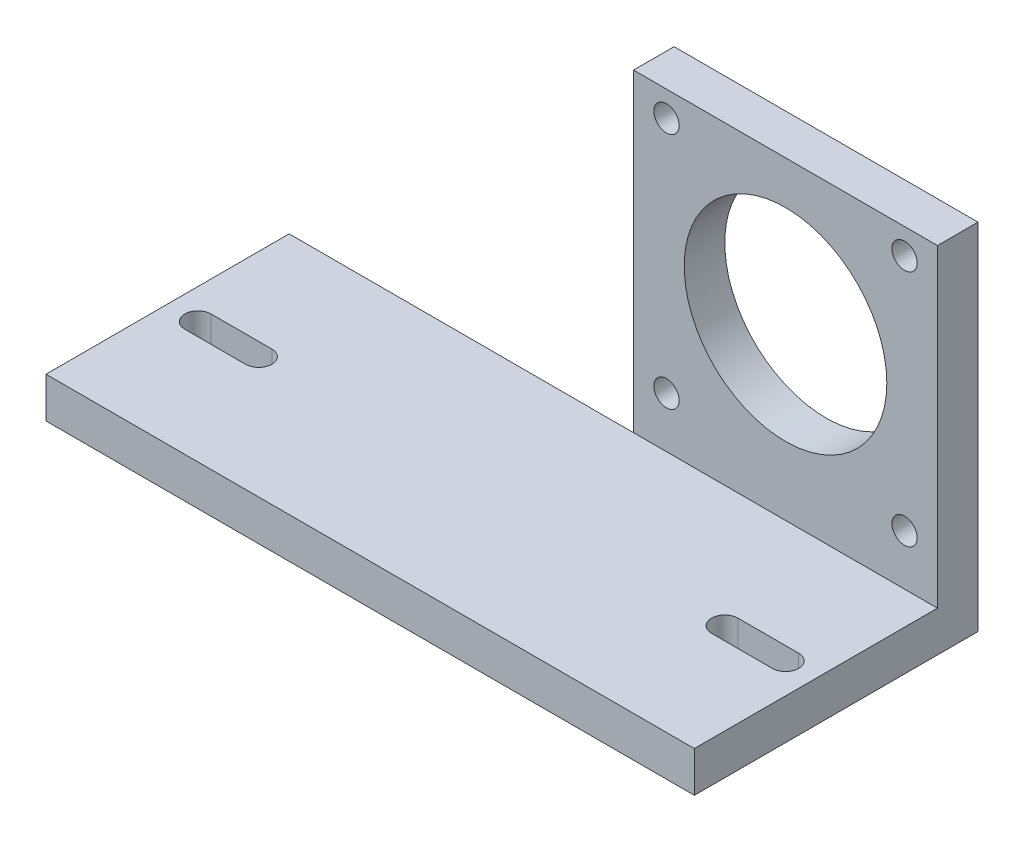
from build123d import *

# Parameters (mm, degrees)
SKETCH_1_W          = 60
SKETCH_1_H          = 70
SKETCH_1_R          = 2.5
SKETCH_1_R_2        = 20
EXTRUDE_1_DEPTH     = 8
SKETCH_2_W          = 128
SKETCH_2_H          = 8
EXTRUDE_2_DEPTH     = 48
CUT_EXTRUDE_1_DEPTH = 129.778880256


with BuildPart() as part:
    # Sketch 1 → Extrude 1 (new body)
    with BuildSketch(Plane.XY):
        with Locations((0, -6.5)):
            Rectangle(SKETCH_1_W, SKETCH_1_H)
        with Locations((-23.5, 23.5)):
            Circle(SKETCH_1_R, mode=Mode.SUBTRACT)
        with Locations((23.5, 23.5)):
            Circle(SKETCH_1_R, mode=Mode.SUBTRACT)
        with Locations((-23.5, -23.5)):
            Circle(SKETCH_1_R, mode=Mode.SUBTRACT)
        with Locations((23.5, -23.5)):
            Circle(SKETCH_1_R, mode=Mode.SUBTRACT)
        Circle(SKETCH_1_R_2, mode=Mode.SUBTRACT)
    extrude(amount=EXTRUDE_1_DEPTH)

    # Sketch 2 → Extrude 2 (add)
    with BuildSketch(Plane.XY.offset(8)):
        with Locations((-34, -37.5)):
            Rectangle(SKETCH_2_W, SKETCH_2_H)
    extrude(amount=EXTRUDE_2_DEPTH)

    # Sketch 3 → Cut-Extrude 1 (cut, through all)
    with BuildSketch(Plane(origin=(0, -33.5, 0), x_dir=(1, 0, 0), z_dir=(0, 1, 0))):
        with BuildLine():
            Line((-92, -29.4), (-80, -29.4))
            ThreePointArc((-80, -29.4), (-77.4, -32), (-80, -34.6))
            Line((-80, -34.6), (-92, -34.6))
            ThreePointArc((-92, -34.6), (-94.6, -32), (-92, -29.4))
        make_face()
        with BuildLine():
            Line((24, -34.6), (12, -34.6))
            ThreePointArc((12, -34.6), (9.4, -32), (12, -29.4))
            Line((12, -29.4), (24, -29.4))
            ThreePointArc((24, -29.4), (26.6, -32), (24, -34.6))
        make_face()
    extrude(amount=-CUT_EXTRUDE_1_DEPTH, mode=Mode.SUBTRACT)


solid = part.part
